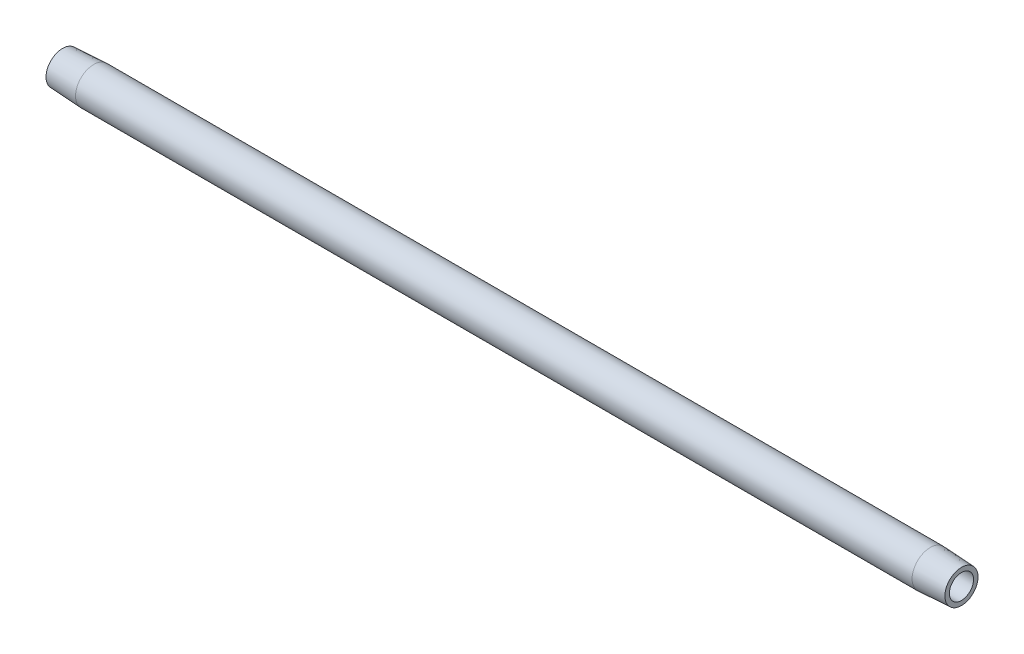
from build123d import *


with BuildPart() as part:
    # Sketch2 → Revolve1 (revolve)
    with BuildSketch(Plane.XY, mode=Mode.PRIVATE) as revolve1_sk:
        Polygon((8.810039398, 5.1435), (0, 4.6817854), (0, 3.4163), (254, 3.4163), (254, 4.6817854), (245.189960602, 5.1435), align=None)
    revolve(revolve1_sk.sketch.rotate(Axis((0.476141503, 0, 0), (1, 0, 0)), 90), axis=Axis((0.476141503, 0, 0), (1, 0, 0)))


solid = part.part
